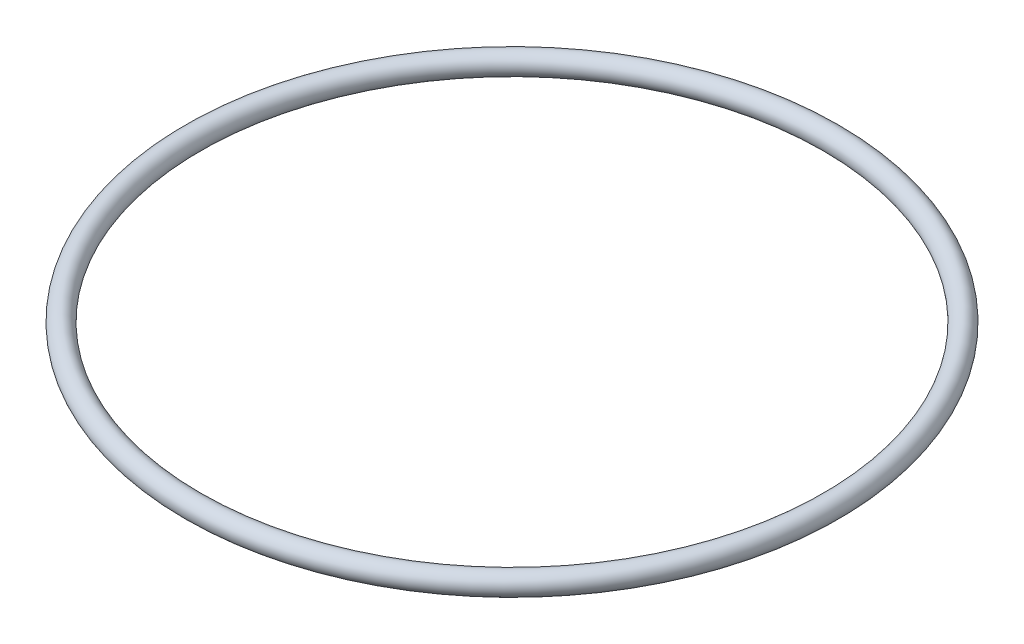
from build123d import *

# Parameters (mm, degrees)
SKETCH2_R = 1.3081


with BuildPart() as part:
    # Sweep1: sweep along a path in Sketch1
    with BuildLine(Plane(origin=(0, 0, 0), x_dir=(1, 0, 0), z_dir=(0, 1, 0))) as sweep1_path:
        CenterArc((0, 0), 37.9349, 0, 360)
    # Sketch2 → Sweep1 (sweep)
    with BuildSketch(Plane.XY):
        with Locations((-39.243, 0)):
            Circle(SKETCH2_R)
    sweep(path=sweep1_path.line)


solid = part.part
